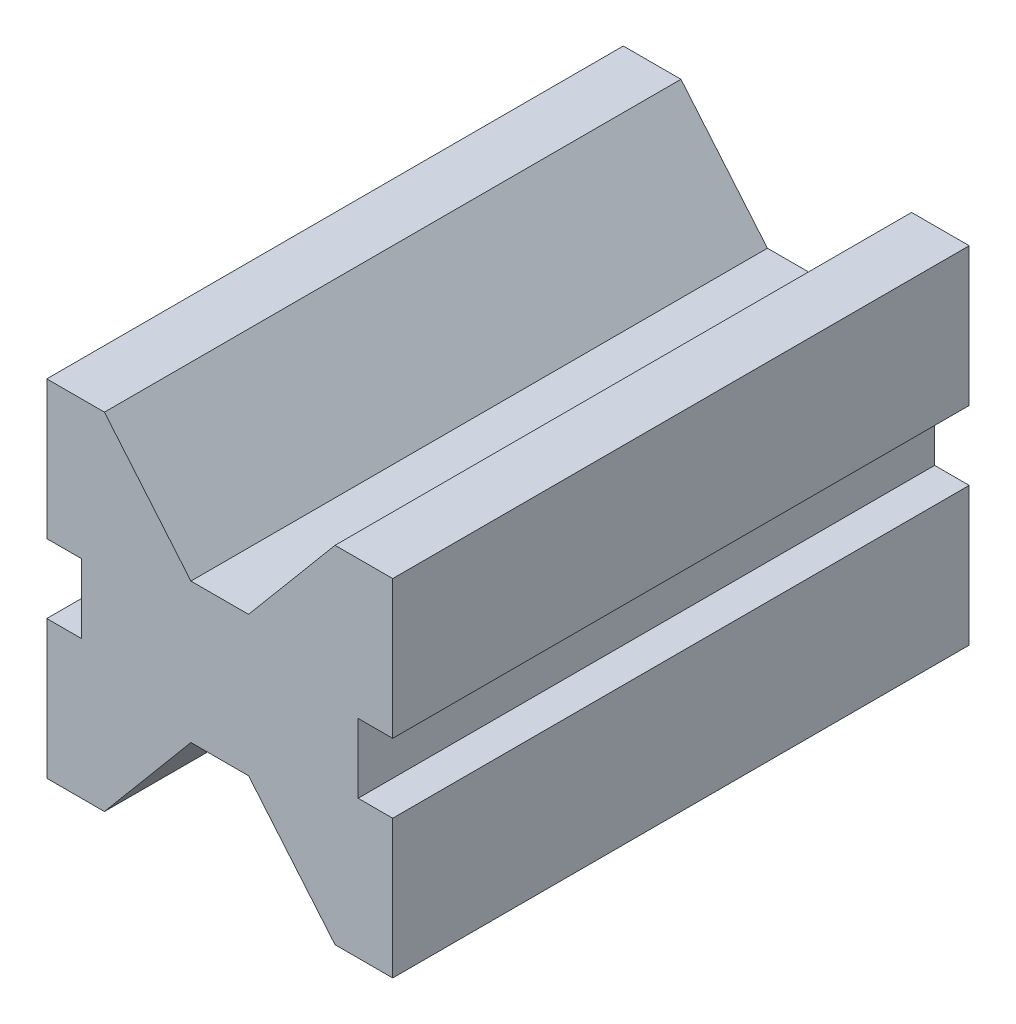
from build123d import *

# Parameters (mm, degrees)
SKETCH1_W          = 60
SKETCH1_H          = 60
EXTRUDE1_DEPTH     = 100
SKETCH2_W          = 6
SKETCH2_H          = 12
CUT_EXTRUDE1_DEPTH = 100


with BuildPart() as part:
    # Sketch1 → Extrude1 (new body)
    with BuildSketch(Plane.XY):
        with Locations((-30, 30)):
            Rectangle(SKETCH1_W, SKETCH1_H)
    extrude(amount=-EXTRUDE1_DEPTH)

    # Sketch2 → Cut-Extrude1 (cut)
    with BuildSketch(Plane.XY):
        Polygon((-50, 0), (-10, 0), (-25, 17.876303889), (-35, 17.876303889), align=None)
        with Locations((-3, 30)):
            Rectangle(SKETCH2_W, SKETCH2_H)
        Polygon((-50, 60), (-10, 60), (-25, 42.123696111), (-35, 42.123696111), align=None)
        with Locations((-57, 30)):
            Rectangle(SKETCH2_W, SKETCH2_H)
    extrude(amount=-CUT_EXTRUDE1_DEPTH, mode=Mode.SUBTRACT)


solid = part.part
